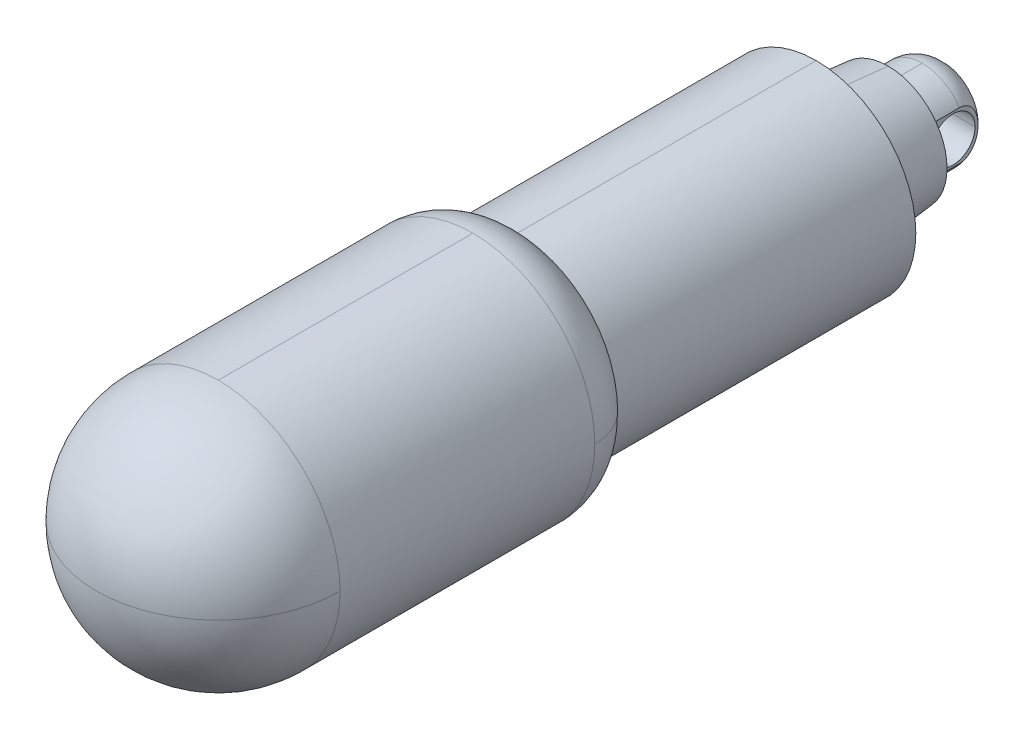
ISO-10303-21;
HEADER;
FILE_DESCRIPTION(('STEP AP214'),'2;1');
FILE_NAME('part.step','',(''),(''),'','','');
FILE_SCHEMA(('AUTOMOTIVE_DESIGN { 1 0 10303 214 1 1 1 1 }'));
ENDSEC;
DATA;
#1=APPLICATION_CONTEXT('core data for automotive mechanical design processes');
#2=APPLICATION_PROTOCOL_DEFINITION('international standard','automotive_design',2000,#1);
#3=PRODUCT_CONTEXT('',#1,'mechanical');
#4=PRODUCT('Part','Part','',(#3));
#5=PRODUCT_RELATED_PRODUCT_CATEGORY('part','',(#4));
#6=PRODUCT_DEFINITION_FORMATION('','',#4);
#7=PRODUCT_DEFINITION_CONTEXT('part definition',#1,'design');
#8=PRODUCT_DEFINITION('design','',#6,#7);
#9=PRODUCT_DEFINITION_SHAPE('','',#8);
#10=(LENGTH_UNIT() NAMED_UNIT(*) SI_UNIT(.MILLI.,.METRE.));
#11=(NAMED_UNIT(*) PLANE_ANGLE_UNIT() SI_UNIT($,.RADIAN.));
#12=(NAMED_UNIT(*) SI_UNIT($,.STERADIAN.) SOLID_ANGLE_UNIT());
#13=UNCERTAINTY_MEASURE_WITH_UNIT(LENGTH_MEASURE(1.E-05),#10,'distance_accuracy_value','');
#14=(GEOMETRIC_REPRESENTATION_CONTEXT(3) GLOBAL_UNCERTAINTY_ASSIGNED_CONTEXT((#13)) GLOBAL_UNIT_ASSIGNED_CONTEXT((#10,
#11,#12)) REPRESENTATION_CONTEXT('',''));
#15=CARTESIAN_POINT('',(0.,0.,0.));
#16=DIRECTION('',(0.,0.,1.));
#17=DIRECTION('',(1.,0.,0.));
#18=AXIS2_PLACEMENT_3D('',#15,#16,#17);
#19=CARTESIAN_POINT('',(0.,-0.75,-3.0833333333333));
#20=DIRECTION('',(0.,0.,-1.));
#21=DIRECTION('',(0.,-1.,0.));
#22=AXIS2_PLACEMENT_3D('',#19,#20,#21);
#23=PLANE('',#22);
#24=CARTESIAN_POINT('',(0.,0.,-3.0833333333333));
#25=DIRECTION('',(0.,0.,1.));
#26=DIRECTION('',(-1.,0.,0.));
#27=AXIS2_PLACEMENT_3D('',#24,#25,#26);
#28=CIRCLE('',#27,1.5);
#29=CARTESIAN_POINT('',(-1.5,0.,-3.0833333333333));
#30=VERTEX_POINT('',#29);
#31=CARTESIAN_POINT('',(0.,-1.5,-3.0833333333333));
#32=VERTEX_POINT('',#31);
#33=EDGE_CURVE('E134',#30,#32,#28,.T.);
#34=ORIENTED_EDGE('',*,*,#33,.F.);
#35=CARTESIAN_POINT('',(0.,0.,-3.0833333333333));
#36=DIRECTION('',(0.,0.,1.));
#37=DIRECTION('',(1.,0.,0.));
#38=AXIS2_PLACEMENT_3D('',#35,#36,#37);
#39=CIRCLE('',#38,1.5);
#40=CARTESIAN_POINT('',(1.5,0.,-3.0833333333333));
#41=VERTEX_POINT('',#40);
#42=EDGE_CURVE('E138',#41,#30,#39,.T.);
#43=ORIENTED_EDGE('',*,*,#42,.F.);
#44=CARTESIAN_POINT('',(0.,0.,-3.0833333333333));
#45=DIRECTION('',(0.,0.,1.));
#46=DIRECTION('',(0.,-1.,0.));
#47=AXIS2_PLACEMENT_3D('',#44,#45,#46);
#48=CIRCLE('',#47,1.5);
#49=EDGE_CURVE('E131',#32,#41,#48,.T.);
#50=ORIENTED_EDGE('',*,*,#49,.F.);
#51=EDGE_LOOP('',(#34,#43,#50));
#52=FACE_BOUND('',#51,.T.);
#53=ADVANCED_FACE('F14',(#52),#23,.T.);
#54=CARTESIAN_POINT('',(-11.,0.,0.));
#55=DIRECTION('',(-1.,0.,0.));
#56=DIRECTION('',(0.,-1.,0.));
#57=AXIS2_PLACEMENT_3D('',#54,#55,#56);
#58=CYLINDRICAL_SURFACE('',#57,2.);
#59=CARTESIAN_POINT('',(3.35,0.,0.));
#60=DIRECTION('',(-1.,0.,0.));
#61=DIRECTION('',(0.,-1.,0.));
#62=AXIS2_PLACEMENT_3D('',#59,#60,#61);
#63=CIRCLE('',#62,2.);
#64=CARTESIAN_POINT('',(3.35,0.,2.));
#65=VERTEX_POINT('',#64);
#66=CARTESIAN_POINT('',(3.35,0.,-2.));
#67=VERTEX_POINT('',#66);
#68=EDGE_CURVE('E201',#65,#67,#63,.F.);
#69=ORIENTED_EDGE('',*,*,#68,.T.);
#70=DIRECTION('',(-1.,0.,0.));
#71=VECTOR('',#70,1.);
#72=CARTESIAN_POINT('',(-11.,0.,-2.));
#73=LINE('',#72,#71);
#74=CARTESIAN_POINT('',(-3.35,0.,-2.));
#75=VERTEX_POINT('',#74);
#76=EDGE_CURVE('E112',#67,#75,#73,.T.);
#77=ORIENTED_EDGE('',*,*,#76,.T.);
#78=CARTESIAN_POINT('',(-3.35,0.,0.));
#79=DIRECTION('',(-1.,0.,0.));
#80=DIRECTION('',(0.,-1.,0.));
#81=AXIS2_PLACEMENT_3D('',#78,#79,#80);
#82=CIRCLE('',#81,2.);
#83=CARTESIAN_POINT('',(-3.35,0.,2.));
#84=VERTEX_POINT('',#83);
#85=EDGE_CURVE('E213',#75,#84,#82,.T.);
#86=ORIENTED_EDGE('',*,*,#85,.T.);
#87=DIRECTION('',(-1.,0.,0.));
#88=VECTOR('',#87,1.);
#89=CARTESIAN_POINT('',(-11.,0.,2.));
#90=LINE('',#89,#88);
#91=EDGE_CURVE('E150',#84,#65,#90,.F.);
#92=ORIENTED_EDGE('',*,*,#91,.T.);
#93=EDGE_LOOP('',(#69,#77,#86,#92));
#94=FACE_BOUND('',#93,.T.);
#95=ADVANCED_FACE('F411',(#94),#58,.F.);
#96=CARTESIAN_POINT('',(-11.,0.,0.));
#97=DIRECTION('',(-1.,0.,0.));
#98=DIRECTION('',(0.,-1.,0.));
#99=AXIS2_PLACEMENT_3D('',#96,#97,#98);
#100=CYLINDRICAL_SURFACE('',#99,2.);
#101=CARTESIAN_POINT('',(-3.35,0.,0.));
#102=DIRECTION('',(-1.,0.,0.));
#103=DIRECTION('',(0.,-1.,0.));
#104=AXIS2_PLACEMENT_3D('',#101,#102,#103);
#105=CIRCLE('',#104,2.);
#106=EDGE_CURVE('E318',#84,#75,#105,.T.);
#107=ORIENTED_EDGE('',*,*,#106,.T.);
#108=ORIENTED_EDGE('',*,*,#76,.F.);
#109=CARTESIAN_POINT('',(3.35,0.,0.));
#110=DIRECTION('',(-1.,0.,0.));
#111=DIRECTION('',(0.,-1.,0.));
#112=AXIS2_PLACEMENT_3D('',#109,#110,#111);
#113=CIRCLE('',#112,2.);
#114=EDGE_CURVE('E18',#67,#65,#113,.F.);
#115=ORIENTED_EDGE('',*,*,#114,.T.);
#116=ORIENTED_EDGE('',*,*,#91,.F.);
#117=EDGE_LOOP('',(#107,#108,#115,#116));
#118=FACE_BOUND('',#117,.T.);
#119=ADVANCED_FACE('F171',(#118),#100,.F.);
#120=CARTESIAN_POINT('',(1.5,0.,-0.583333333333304));
#121=DIRECTION('',(0.,1.,0.));
#122=DIRECTION('',(1.,0.,0.));
#123=AXIS2_PLACEMENT_3D('',#120,#121,#122);
#124=CIRCLE('',#123,2.5);
#125=TRIMMED_CURVE('',#124,(PARAMETER_VALUE(-2.21429743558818)),
(PARAMETER_VALUE(2.21429743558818)),.T.,.PARAMETER.);
#126=CARTESIAN_POINT('',(0.,0.,-0.583333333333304));
#127=DIRECTION('',(0.,0.,1.));
#128=AXIS1_PLACEMENT('',#126,#127);
#129=SURFACE_OF_REVOLUTION('',#125,#128);
#130=ORIENTED_EDGE('',*,*,#33,.T.);
#131=ORIENTED_EDGE('',*,*,#49,.T.);
#132=CARTESIAN_POINT('',(1.5,0.,-0.583333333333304));
#133=DIRECTION('',(0.,1.,0.));
#134=DIRECTION('',(1.,0.,0.));
#135=AXIS2_PLACEMENT_3D('',#132,#133,#134);
#136=CIRCLE('',#135,2.5);
#137=CARTESIAN_POINT('',(3.35,0.,-2.2648505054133));
#138=VERTEX_POINT('',#137);
#139=EDGE_CURVE('E143',#138,#41,#136,.T.);
#140=ORIENTED_EDGE('',*,*,#139,.F.);
#141=CARTESIAN_POINT('',(3.35,0.,-2.2648505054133));
#142=CARTESIAN_POINT('',(3.35,-0.0754425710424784,-2.26483182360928));
#143=CARTESIAN_POINT('',(3.35,-0.150894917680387,-2.26204566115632));
#144=CARTESIAN_POINT('',(3.35,-0.301463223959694,-2.25079679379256));
#145=CARTESIAN_POINT('',(3.35,-0.376578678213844,-2.24232735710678));
#146=CARTESIAN_POINT('',(3.35,-0.526652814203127,-2.21946055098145));
#147=CARTESIAN_POINT('',(3.35,-0.601603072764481,-2.20500707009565));
#148=CARTESIAN_POINT('',(3.35,-0.750000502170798,-2.16992943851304));
#149=CARTESIAN_POINT('',(3.35,-0.823448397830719,-2.14930834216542));
#150=CARTESIAN_POINT('',(3.35,-1.00988032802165,-2.08785206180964));
#151=CARTESIAN_POINT('',(3.35000000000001,-1.1213408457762,-2.04220953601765));
#152=CARTESIAN_POINT('',(3.34999999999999,-1.33522725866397,-1.93376510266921));
#153=CARTESIAN_POINT('',(3.34999999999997,-1.43768585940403,-1.87102902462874));
#154=CARTESIAN_POINT('',(3.35000000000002,-1.60964311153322,-1.74246365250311));
#155=CARTESIAN_POINT('',(3.35000000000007,-1.68158732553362,-1.67992206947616));
#156=CARTESIAN_POINT('',(3.34999999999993,-1.81436566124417,-1.54384878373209));
#157=CARTESIAN_POINT('',(3.34999999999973,-1.87519707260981,-1.4703144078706));
#158=CARTESIAN_POINT('',(3.34999999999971,-1.98313209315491,-1.31268560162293));
#159=CARTESIAN_POINT('',(3.34999999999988,-2.03011755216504,-1.22850857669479));
#160=CARTESIAN_POINT('',(3.35000000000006,-2.08749421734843,-1.09673181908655));
#161=CARTESIAN_POINT('',(3.35000000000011,-2.10443360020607,-1.0518995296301));
#162=CARTESIAN_POINT('',(3.34999999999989,-2.13369721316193,-0.960761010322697));
#163=CARTESIAN_POINT('',(3.34999999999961,-2.14602396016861,-0.914455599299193));
#164=CARTESIAN_POINT('',(3.34999999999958,-2.16580487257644,-0.820926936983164));
#165=CARTESIAN_POINT('',(3.34999999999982,-2.17327015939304,-0.773706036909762));
#166=CARTESIAN_POINT('',(3.35000000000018,-2.18324910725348,-0.678770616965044));
#167=CARTESIAN_POINT('',(3.35000000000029,-2.1857654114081,-0.63105637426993));
#168=CARTESIAN_POINT('',(3.35,-2.18574929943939,-0.583333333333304));
#169=B_SPLINE_CURVE_WITH_KNOTS('',3,(#141,#142,#143,#144,#145,#146,#147,#148,#149,#150,#151,
#152,#153,#154,#155,#156,#157,#158,#159,#160,#161,#162,#163,#164,#165,#166,#167,#168),
.UNSPECIFIED.,.F.,.F.,(4,2,2,2,2,2,2,2,2,2,2,2,2,4),(0.,0.2262913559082,0.452851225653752,
0.681585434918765,0.910206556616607,1.27014773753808,1.62872186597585,1.91357555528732,
2.19849862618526,2.48578692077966,2.62935968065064,2.77285398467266,2.91601885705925,
3.05910724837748),.UNSPECIFIED.);
#170=CARTESIAN_POINT('',(3.35,-2.1857492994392,-0.583333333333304));
#171=VERTEX_POINT('',#170);
#172=EDGE_CURVE('E312',#138,#171,#169,.T.);
#173=ORIENTED_EDGE('',*,*,#172,.T.);
#174=CARTESIAN_POINT('',(0.,0.,-0.583333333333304));
#175=DIRECTION('',(0.,0.,-1.));
#176=DIRECTION('',(1.,0.,0.));
#177=AXIS2_PLACEMENT_3D('',#174,#175,#176);
#178=CIRCLE('',#177,4.);
#179=CARTESIAN_POINT('',(0.,-4.,-0.583333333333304));
#180=VERTEX_POINT('',#179);
#181=EDGE_CURVE('E195',#180,#171,#178,.F.);
#182=ORIENTED_EDGE('',*,*,#181,.F.);
#183=CARTESIAN_POINT('',(0.,0.,-0.583333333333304));
#184=DIRECTION('',(0.,0.,-1.));
#185=DIRECTION('',(1.,0.,0.));
#186=AXIS2_PLACEMENT_3D('',#183,#184,#185);
#187=CIRCLE('',#186,4.);
#188=CARTESIAN_POINT('',(-3.35,-2.1857492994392,-0.583333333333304));
#189=VERTEX_POINT('',#188);
#190=EDGE_CURVE('E119',#189,#180,#187,.F.);
#191=ORIENTED_EDGE('',*,*,#190,.F.);
#192=CARTESIAN_POINT('',(-3.35,-2.18574929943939,-0.583333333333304));
#193=CARTESIAN_POINT('',(-3.35,-2.1857602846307,-0.626622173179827));
#194=CARTESIAN_POINT('',(-3.35,-2.18369202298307,-0.669905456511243));
#195=CARTESIAN_POINT('',(-3.35,-2.17548130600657,-0.756064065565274));
#196=CARTESIAN_POINT('',(-3.35,-2.16934076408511,-0.798939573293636));
#197=CARTESIAN_POINT('',(-3.35,-2.15311794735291,-0.883674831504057));
#198=CARTESIAN_POINT('',(-3.35,-2.14305929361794,-0.925539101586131));
#199=CARTESIAN_POINT('',(-3.35,-2.11916399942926,-1.008163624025));
#200=CARTESIAN_POINT('',(-3.35,-2.10532713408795,-1.04892381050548));
#201=CARTESIAN_POINT('',(-3.35,-2.05847222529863,-1.16896268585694));
#202=CARTESIAN_POINT('',(-3.35,-2.02006977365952,-1.24620337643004));
#203=CARTESIAN_POINT('',(-3.35,-1.93091834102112,-1.39316793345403));
#204=CARTESIAN_POINT('',(-3.35,-1.88015621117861,-1.46288367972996));
#205=CARTESIAN_POINT('',(-3.35,-1.768402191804,-1.5937973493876));
#206=CARTESIAN_POINT('',(-3.35,-1.70738594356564,-1.65497434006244));
#207=CARTESIAN_POINT('',(-3.35,-1.57742304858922,-1.76811368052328));
#208=CARTESIAN_POINT('',(-3.35,-1.50847575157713,-1.82007527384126));
#209=CARTESIAN_POINT('',(-3.35,-1.32954562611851,-1.93786242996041));
#210=CARTESIAN_POINT('',(-3.35,-1.21590781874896,-1.99814822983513));
#211=CARTESIAN_POINT('',(-3.35,-0.980125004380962,-2.09968218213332));
#212=CARTESIAN_POINT('',(-3.34999999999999,-0.857950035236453,-2.14085896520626));
#213=CARTESIAN_POINT('',(-3.35,-0.673529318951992,-2.1887320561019));
#214=CARTESIAN_POINT('',(-3.35000000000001,-0.612952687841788,-2.20224909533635));
#215=CARTESIAN_POINT('',(-3.34999999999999,-0.491029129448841,-2.22529015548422));
#216=CARTESIAN_POINT('',(-3.34999999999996,-0.429682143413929,-2.23481386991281));
#217=CARTESIAN_POINT('',(-3.35000000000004,-0.307044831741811,-2.24991444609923));
#218=CARTESIAN_POINT('',(-3.35000000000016,-0.245758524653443,-2.25552442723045));
#219=CARTESIAN_POINT('',(-3.34999999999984,-0.122980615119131,-2.26298753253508));
#220=CARTESIAN_POINT('',(-3.34999999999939,-0.0614891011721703,-2.2648421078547));
#221=CARTESIAN_POINT('',(-3.3499999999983,0.,-2.2648505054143));
#222=B_SPLINE_CURVE_WITH_KNOTS('',3,(#192,#193,#194,#195,#196,#197,#198,#199,#200,#201,#202,
#203,#204,#205,#206,#207,#208,#209,#210,#211,#212,#213,#214,#215,#216,#217,#218,#219,#220,#221),
.UNSPECIFIED.,.F.,.F.,(4,2,2,2,2,2,2,2,2,2,2,2,2,2,4),(0.,0.12980795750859,0.259554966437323,
0.388531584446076,0.517515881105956,0.774870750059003,1.03250061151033,1.29075135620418,
1.54902329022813,1.93284731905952,2.31809356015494,2.50418781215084,2.69029634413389,
2.87481020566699,3.05925275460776),.UNSPECIFIED.);
#223=CARTESIAN_POINT('',(-3.35,0.,-2.2648505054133));
#224=VERTEX_POINT('',#223);
#225=EDGE_CURVE('E263',#189,#224,#222,.T.);
#226=ORIENTED_EDGE('',*,*,#225,.T.);
#227=CARTESIAN_POINT('',(-1.5,0.,-0.583333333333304));
#228=DIRECTION('',(0.,-1.,0.));
#229=DIRECTION('',(-1.,0.,0.));
#230=AXIS2_PLACEMENT_3D('',#227,#228,#229);
#231=CIRCLE('',#230,2.5);
#232=EDGE_CURVE('E149',#30,#224,#231,.F.);
#233=ORIENTED_EDGE('',*,*,#232,.F.);
#234=EDGE_LOOP('',(#130,#131,#140,#173,#182,#191,#226,#233));
#235=FACE_BOUND('',#234,.T.);
#236=ADVANCED_FACE('F147',(#235),#129,.F.);
#237=CARTESIAN_POINT('',(1.5,0.,-0.583333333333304));
#238=DIRECTION('',(0.,1.,0.));
#239=DIRECTION('',(1.,0.,0.));
#240=AXIS2_PLACEMENT_3D('',#237,#238,#239);
#241=CIRCLE('',#240,2.5);
#242=TRIMMED_CURVE('',#241,(PARAMETER_VALUE(-2.21429743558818)),
(PARAMETER_VALUE(2.21429743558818)),.T.,.PARAMETER.);
#243=CARTESIAN_POINT('',(0.,0.,-0.583333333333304));
#244=DIRECTION('',(0.,0.,1.));
#245=AXIS1_PLACEMENT('',#243,#244);
#246=SURFACE_OF_REVOLUTION('',#242,#245);
#247=CARTESIAN_POINT('',(0.,0.,-0.583333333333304));
#248=DIRECTION('',(0.,0.,-1.));
#249=DIRECTION('',(1.,0.,0.));
#250=AXIS2_PLACEMENT_3D('',#247,#248,#249);
#251=CIRCLE('',#250,4.);
#252=CARTESIAN_POINT('',(3.35,2.18574929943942,-0.583333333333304));
#253=VERTEX_POINT('',#252);
#254=CARTESIAN_POINT('',(0.,4.,-0.583333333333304));
#255=VERTEX_POINT('',#254);
#256=EDGE_CURVE('E188',#253,#255,#251,.F.);
#257=ORIENTED_EDGE('',*,*,#256,.F.);
#258=CARTESIAN_POINT('',(3.35,2.18574929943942,-0.583333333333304));
#259=CARTESIAN_POINT('',(3.35,2.18576028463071,-0.62662217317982));
#260=CARTESIAN_POINT('',(3.35,2.18369202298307,-0.669905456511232));
#261=CARTESIAN_POINT('',(3.35,2.17548130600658,-0.756064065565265));
#262=CARTESIAN_POINT('',(3.35,2.16934076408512,-0.798939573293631));
#263=CARTESIAN_POINT('',(3.35,2.15311794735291,-0.883674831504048));
#264=CARTESIAN_POINT('',(3.35,2.14305929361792,-0.925539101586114));
#265=CARTESIAN_POINT('',(3.35,2.11916399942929,-1.00816362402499));
#266=CARTESIAN_POINT('',(3.35,2.10532713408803,-1.04892381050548));
#267=CARTESIAN_POINT('',(3.35,2.05847222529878,-1.16896268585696));
#268=CARTESIAN_POINT('',(3.35,2.02006977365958,-1.24620337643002));
#269=CARTESIAN_POINT('',(3.35,1.93091834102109,-1.393167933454));
#270=CARTESIAN_POINT('',(3.35,1.88015621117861,-1.46288367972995));
#271=CARTESIAN_POINT('',(3.35,1.76840219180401,-1.5937973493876));
#272=CARTESIAN_POINT('',(3.35,1.70738594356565,-1.65497434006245));
#273=CARTESIAN_POINT('',(3.35,1.57742304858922,-1.76811368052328));
#274=CARTESIAN_POINT('',(3.35,1.50847575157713,-1.82007527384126));
#275=CARTESIAN_POINT('',(3.35,1.32954562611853,-1.9378624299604));
#276=CARTESIAN_POINT('',(3.35,1.21590781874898,-1.9981482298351));
#277=CARTESIAN_POINT('',(3.35,0.980125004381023,-2.0996821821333));
#278=CARTESIAN_POINT('',(3.34999999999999,0.857950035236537,-2.14085896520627));
#279=CARTESIAN_POINT('',(3.35,0.673529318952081,-2.1887320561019));
#280=CARTESIAN_POINT('',(3.35000000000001,0.612952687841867,-2.20224909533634));
#281=CARTESIAN_POINT('',(3.34999999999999,0.491029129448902,-2.2252901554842));
#282=CARTESIAN_POINT('',(3.34999999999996,0.429682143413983,-2.2348138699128));
#283=CARTESIAN_POINT('',(3.35000000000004,0.30704483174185,-2.24991444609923));
#284=CARTESIAN_POINT('',(3.35000000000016,0.245758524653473,-2.25552442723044));
#285=CARTESIAN_POINT('',(3.34999999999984,0.122980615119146,-2.26298753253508));
#286=CARTESIAN_POINT('',(3.34999999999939,0.0614891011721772,-2.2648421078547));
#287=CARTESIAN_POINT('',(3.3499999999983,0.,-2.2648505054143));
#288=B_SPLINE_CURVE_WITH_KNOTS('',3,(#258,#259,#260,#261,#262,#263,#264,#265,#266,#267,#268,
#269,#270,#271,#272,#273,#274,#275,#276,#277,#278,#279,#280,#281,#282,#283,#284,#285,#286,#287),
.UNSPECIFIED.,.F.,.F.,(4,2,2,2,2,2,2,2,2,2,2,2,2,2,4),(0.,0.129807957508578,0.259554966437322,
0.388531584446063,0.517515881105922,0.77487075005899,1.03250061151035,1.2907513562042,
1.54902329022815,1.93284731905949,2.31809356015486,2.50418781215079,2.69029634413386,
2.87481020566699,3.05925275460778),.UNSPECIFIED.);
#289=EDGE_CURVE('E306',#253,#138,#288,.T.);
#290=ORIENTED_EDGE('',*,*,#289,.T.);
#291=ORIENTED_EDGE('',*,*,#139,.T.);
#292=ORIENTED_EDGE('',*,*,#42,.T.);
#293=ORIENTED_EDGE('',*,*,#232,.T.);
#294=CARTESIAN_POINT('',(-3.35,0.,-2.2648505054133));
#295=CARTESIAN_POINT('',(-3.35,0.0754425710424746,-2.26483182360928));
#296=CARTESIAN_POINT('',(-3.35,0.150894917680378,-2.26204566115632));
#297=CARTESIAN_POINT('',(-3.35,0.301463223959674,-2.25079679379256));
#298=CARTESIAN_POINT('',(-3.35,0.376578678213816,-2.24232735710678));
#299=CARTESIAN_POINT('',(-3.35,0.526652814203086,-2.21946055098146));
#300=CARTESIAN_POINT('',(-3.35,0.601603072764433,-2.20500707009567));
#301=CARTESIAN_POINT('',(-3.35,0.750000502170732,-2.16992943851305));
#302=CARTESIAN_POINT('',(-3.35,0.823448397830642,-2.14930834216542));
#303=CARTESIAN_POINT('',(-3.35,1.00988032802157,-2.08785206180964));
#304=CARTESIAN_POINT('',(-3.35000000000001,1.12134084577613,-2.04220953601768));
#305=CARTESIAN_POINT('',(-3.34999999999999,1.3352272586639,-1.93376510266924));
#306=CARTESIAN_POINT('',(-3.34999999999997,1.43768585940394,-1.87102902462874));
#307=CARTESIAN_POINT('',(-3.35000000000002,1.60964311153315,-1.7424636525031));
#308=CARTESIAN_POINT('',(-3.35000000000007,1.68158732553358,-1.67992206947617));
#309=CARTESIAN_POINT('',(-3.34999999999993,1.81436566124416,-1.54384878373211));
#310=CARTESIAN_POINT('',(-3.34999999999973,1.87519707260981,-1.47031440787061));
#311=CARTESIAN_POINT('',(-3.34999999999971,1.98313209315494,-1.31268560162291));
#312=CARTESIAN_POINT('',(-3.34999999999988,2.03011755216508,-1.22850857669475));
#313=CARTESIAN_POINT('',(-3.35000000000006,2.08749421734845,-1.09673181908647));
#314=CARTESIAN_POINT('',(-3.35000000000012,2.10443360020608,-1.05189952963));
#315=CARTESIAN_POINT('',(-3.34999999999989,2.13369721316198,-0.960761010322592));
#316=CARTESIAN_POINT('',(-3.34999999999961,2.14602396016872,-0.914455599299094));
#317=CARTESIAN_POINT('',(-3.34999999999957,2.16580487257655,-0.820926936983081));
#318=CARTESIAN_POINT('',(-3.34999999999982,2.17327015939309,-0.77370603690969));
#319=CARTESIAN_POINT('',(-3.35000000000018,2.18324910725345,-0.678770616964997));
#320=CARTESIAN_POINT('',(-3.35000000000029,2.18576541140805,-0.631056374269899));
#321=CARTESIAN_POINT('',(-3.35,2.18574929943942,-0.583333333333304));
#322=B_SPLINE_CURVE_WITH_KNOTS('',3,(#294,#295,#296,#297,#298,#299,#300,#301,#302,#303,#304,
#305,#306,#307,#308,#309,#310,#311,#312,#313,#314,#315,#316,#317,#318,#319,#320,#321),
.UNSPECIFIED.,.F.,.F.,(4,2,2,2,2,2,2,2,2,2,2,2,2,4),(0.,0.226291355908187,0.452851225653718,
0.681585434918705,0.910206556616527,1.270147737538,1.62872186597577,1.91357555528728,
2.19849862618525,2.48578692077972,2.62935968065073,2.77285398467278,2.9160188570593,
3.05910724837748),.UNSPECIFIED.);
#323=CARTESIAN_POINT('',(-3.35,2.18574929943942,-0.583333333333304));
#324=VERTEX_POINT('',#323);
#325=EDGE_CURVE('E256',#224,#324,#322,.T.);
#326=ORIENTED_EDGE('',*,*,#325,.T.);
#327=CARTESIAN_POINT('',(0.,0.,-0.583333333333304));
#328=DIRECTION('',(0.,0.,-1.));
#329=DIRECTION('',(1.,0.,0.));
#330=AXIS2_PLACEMENT_3D('',#327,#328,#329);
#331=CIRCLE('',#330,4.);
#332=EDGE_CURVE('E210',#255,#324,#331,.F.);
#333=ORIENTED_EDGE('',*,*,#332,.F.);
#334=EDGE_LOOP('',(#257,#290,#291,#292,#293,#326,#333));
#335=FACE_BOUND('',#334,.T.);
#336=ADVANCED_FACE('F170',(#335),#246,.F.);
#337=CARTESIAN_POINT('',(0.,0.,0.958333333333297));
#338=DIRECTION('',(0.,0.,-1.));
#339=DIRECTION('',(1.,0.,0.));
#340=AXIS2_PLACEMENT_3D('',#337,#338,#339);
#341=CYLINDRICAL_SURFACE('',#340,4.);
#342=DIRECTION('',(0.,0.,1.));
#343=VECTOR('',#342,1.);
#344=CARTESIAN_POINT('',(-3.35,-2.18574929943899,2.5));
#345=LINE('',#344,#343);
#346=CARTESIAN_POINT('',(-3.35,-2.1857492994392,2.5));
#347=VERTEX_POINT('',#346);
#348=EDGE_CURVE('E269',#347,#189,#345,.F.);
#349=ORIENTED_EDGE('',*,*,#348,.T.);
#350=ORIENTED_EDGE('',*,*,#190,.T.);
#351=DIRECTION('',(0.,0.,-1.));
#352=VECTOR('',#351,1.);
#353=CARTESIAN_POINT('',(0.,-4.,0.958333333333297));
#354=LINE('',#353,#352);
#355=CARTESIAN_POINT('',(0.,-4.,2.5));
#356=VERTEX_POINT('',#355);
#357=EDGE_CURVE('E183',#356,#180,#354,.T.);
#358=ORIENTED_EDGE('',*,*,#357,.F.);
#359=CARTESIAN_POINT('',(0.,0.,2.5));
#360=DIRECTION('',(0.,0.,-1.));
#361=DIRECTION('',(1.,0.,0.));
#362=AXIS2_PLACEMENT_3D('',#359,#360,#361);
#363=CIRCLE('',#362,4.);
#364=EDGE_CURVE('E267',#347,#356,#363,.F.);
#365=ORIENTED_EDGE('',*,*,#364,.F.);
#366=EDGE_LOOP('',(#349,#350,#358,#365));
#367=FACE_BOUND('',#366,.T.);
#368=ADVANCED_FACE('F660',(#367),#341,.T.);
#369=CARTESIAN_POINT('',(0.,0.,0.958333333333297));
#370=DIRECTION('',(0.,0.,-1.));
#371=DIRECTION('',(1.,0.,0.));
#372=AXIS2_PLACEMENT_3D('',#369,#370,#371);
#373=CYLINDRICAL_SURFACE('',#372,4.);
#374=DIRECTION('',(0.,0.,-1.));
#375=VECTOR('',#374,1.);
#376=CARTESIAN_POINT('',(3.35,-2.18574929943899,-2.5833333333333));
#377=LINE('',#376,#375);
#378=CARTESIAN_POINT('',(3.35,-2.1857492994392,2.5));
#379=VERTEX_POINT('',#378);
#380=EDGE_CURVE('E206',#171,#379,#377,.F.);
#381=ORIENTED_EDGE('',*,*,#380,.T.);
#382=CARTESIAN_POINT('',(0.,0.,2.5));
#383=DIRECTION('',(0.,0.,-1.));
#384=DIRECTION('',(1.,0.,0.));
#385=AXIS2_PLACEMENT_3D('',#382,#383,#384);
#386=CIRCLE('',#385,4.);
#387=EDGE_CURVE('E332',#356,#379,#386,.F.);
#388=ORIENTED_EDGE('',*,*,#387,.F.);
#389=ORIENTED_EDGE('',*,*,#357,.T.);
#390=ORIENTED_EDGE('',*,*,#181,.T.);
#391=EDGE_LOOP('',(#381,#388,#389,#390));
#392=FACE_BOUND('',#391,.T.);
#393=ADVANCED_FACE('F302',(#392),#373,.T.);
#394=CARTESIAN_POINT('',(3.35,11.,-2.5833333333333));
#395=DIRECTION('',(-1.,0.,0.));
#396=DIRECTION('',(0.,0.,-1.));
#397=AXIS2_PLACEMENT_3D('',#394,#395,#396);
#398=PLANE('',#397);
#399=ORIENTED_EDGE('',*,*,#172,.F.);
#400=ORIENTED_EDGE('',*,*,#289,.F.);
#401=DIRECTION('',(0.,0.,-1.));
#402=VECTOR('',#401,1.);
#403=CARTESIAN_POINT('',(3.35,2.18574929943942,0.958333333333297));
#404=LINE('',#403,#402);
#405=CARTESIAN_POINT('',(3.35,2.18574929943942,2.5));
#406=VERTEX_POINT('',#405);
#407=EDGE_CURVE('E192',#406,#253,#404,.T.);
#408=ORIENTED_EDGE('',*,*,#407,.F.);
#409=DIRECTION('',(0.,-1.,0.));
#410=VECTOR('',#409,1.);
#411=CARTESIAN_POINT('',(3.35,-4.65841123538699,2.5));
#412=LINE('',#411,#410);
#413=EDGE_CURVE('E336',#379,#406,#412,.F.);
#414=ORIENTED_EDGE('',*,*,#413,.F.);
#415=ORIENTED_EDGE('',*,*,#380,.F.);
#416=EDGE_LOOP('',(#399,#400,#408,#414,#415));
#417=FACE_BOUND('',#416,.T.);
#418=ORIENTED_EDGE('',*,*,#114,.F.);
#419=ORIENTED_EDGE('',*,*,#68,.F.);
#420=EDGE_LOOP('',(#418,#419));
#421=FACE_BOUND('',#420,.T.);
#422=ADVANCED_FACE('F297',(#417,#421),#398,.F.);
#423=CARTESIAN_POINT('',(0.,0.,0.958333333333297));
#424=DIRECTION('',(0.,0.,-1.));
#425=DIRECTION('',(1.,0.,0.));
#426=AXIS2_PLACEMENT_3D('',#423,#424,#425);
#427=CYLINDRICAL_SURFACE('',#426,4.);
#428=ORIENTED_EDGE('',*,*,#407,.T.);
#429=ORIENTED_EDGE('',*,*,#256,.T.);
#430=DIRECTION('',(0.,0.,-1.));
#431=VECTOR('',#430,1.);
#432=CARTESIAN_POINT('',(0.,4.,0.958333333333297));
#433=LINE('',#432,#431);
#434=CARTESIAN_POINT('',(0.,4.,2.5));
#435=VERTEX_POINT('',#434);
#436=EDGE_CURVE('E191',#435,#255,#433,.T.);
#437=ORIENTED_EDGE('',*,*,#436,.F.);
#438=CARTESIAN_POINT('',(0.,0.,2.5));
#439=DIRECTION('',(0.,0.,-1.));
#440=DIRECTION('',(1.,0.,0.));
#441=AXIS2_PLACEMENT_3D('',#438,#439,#440);
#442=CIRCLE('',#441,4.);
#443=EDGE_CURVE('E340',#406,#435,#442,.F.);
#444=ORIENTED_EDGE('',*,*,#443,.F.);
#445=EDGE_LOOP('',(#428,#429,#437,#444));
#446=FACE_BOUND('',#445,.T.);
#447=ADVANCED_FACE('F293',(#446),#427,.T.);
#448=CARTESIAN_POINT('',(0.,0.,0.958333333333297));
#449=DIRECTION('',(0.,0.,-1.));
#450=DIRECTION('',(1.,0.,0.));
#451=AXIS2_PLACEMENT_3D('',#448,#449,#450);
#452=CYLINDRICAL_SURFACE('',#451,4.);
#453=DIRECTION('',(0.,0.,1.));
#454=VECTOR('',#453,1.);
#455=CARTESIAN_POINT('',(-3.35,2.18574929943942,2.5));
#456=LINE('',#455,#454);
#457=CARTESIAN_POINT('',(-3.35,2.18574929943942,2.5));
#458=VERTEX_POINT('',#457);
#459=EDGE_CURVE('E265',#324,#458,#456,.T.);
#460=ORIENTED_EDGE('',*,*,#459,.T.);
#461=CARTESIAN_POINT('',(0.,0.,2.5));
#462=DIRECTION('',(0.,0.,-1.));
#463=DIRECTION('',(1.,0.,0.));
#464=AXIS2_PLACEMENT_3D('',#461,#462,#463);
#465=CIRCLE('',#464,4.);
#466=EDGE_CURVE('E346',#435,#458,#465,.F.);
#467=ORIENTED_EDGE('',*,*,#466,.F.);
#468=ORIENTED_EDGE('',*,*,#436,.T.);
#469=ORIENTED_EDGE('',*,*,#332,.T.);
#470=EDGE_LOOP('',(#460,#467,#468,#469));
#471=FACE_BOUND('',#470,.T.);
#472=ADVANCED_FACE('F288',(#471),#452,.T.);
#473=CARTESIAN_POINT('',(-3.35,11.,2.5));
#474=DIRECTION('',(1.,0.,0.));
#475=DIRECTION('',(0.,0.,1.));
#476=AXIS2_PLACEMENT_3D('',#473,#474,#475);
#477=PLANE('',#476);
#478=ORIENTED_EDGE('',*,*,#325,.F.);
#479=ORIENTED_EDGE('',*,*,#225,.F.);
#480=ORIENTED_EDGE('',*,*,#348,.F.);
#481=DIRECTION('',(0.,-1.,0.));
#482=VECTOR('',#481,1.);
#483=CARTESIAN_POINT('',(-3.35,-4.65841123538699,2.5));
#484=LINE('',#483,#482);
#485=EDGE_CURVE('E348',#458,#347,#484,.T.);
#486=ORIENTED_EDGE('',*,*,#485,.F.);
#487=ORIENTED_EDGE('',*,*,#459,.F.);
#488=EDGE_LOOP('',(#478,#479,#480,#486,#487));
#489=FACE_BOUND('',#488,.T.);
#490=ORIENTED_EDGE('',*,*,#85,.F.);
#491=ORIENTED_EDGE('',*,*,#106,.F.);
#492=EDGE_LOOP('',(#490,#491));
#493=FACE_BOUND('',#492,.T.);
#494=ADVANCED_FACE('F260',(#489,#493),#477,.F.);
#495=CARTESIAN_POINT('',(0.,-4.65841123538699,2.5));
#496=DIRECTION('',(0.,0.,-1.));
#497=DIRECTION('',(0.,-1.,0.));
#498=AXIS2_PLACEMENT_3D('',#495,#496,#497);
#499=PLANE('',#498);
#500=ORIENTED_EDGE('',*,*,#466,.T.);
#501=ORIENTED_EDGE('',*,*,#485,.T.);
#502=ORIENTED_EDGE('',*,*,#364,.T.);
#503=ORIENTED_EDGE('',*,*,#387,.T.);
#504=ORIENTED_EDGE('',*,*,#413,.T.);
#505=ORIENTED_EDGE('',*,*,#443,.T.);
#506=EDGE_LOOP('',(#500,#501,#502,#503,#504,#505));
#507=FACE_BOUND('',#506,.T.);
#508=CARTESIAN_POINT('',(0.,0.,2.4999999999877));
#509=DIRECTION('',(0.,0.,1.));
#510=DIRECTION('',(-1.,0.,0.));
#511=AXIS2_PLACEMENT_3D('',#508,#509,#510);
#512=CIRCLE('',#511,5.31682247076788);
#513=CARTESIAN_POINT('',(0.,5.31682247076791,2.4999999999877));
#514=VERTEX_POINT('',#513);
#515=CARTESIAN_POINT('',(-3.34999999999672,-4.128692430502,2.4999999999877));
#516=VERTEX_POINT('',#515);
#517=EDGE_CURVE('E352',#514,#516,#512,.T.);
#518=ORIENTED_EDGE('',*,*,#517,.F.);
#519=CARTESIAN_POINT('',(0.,0.,2.4999999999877));
#520=DIRECTION('',(0.,0.,1.));
#521=DIRECTION('',(-1.,0.,0.));
#522=AXIS2_PLACEMENT_3D('',#519,#520,#521);
#523=CIRCLE('',#522,5.31682247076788);
#524=CARTESIAN_POINT('',(0.,-5.3168224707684,2.4999999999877));
#525=VERTEX_POINT('',#524);
#526=EDGE_CURVE('E349',#525,#514,#523,.T.);
#527=ORIENTED_EDGE('',*,*,#526,.F.);
#528=CARTESIAN_POINT('',(0.,0.,2.4999999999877));
#529=DIRECTION('',(0.,0.,1.));
#530=DIRECTION('',(-1.,0.,0.));
#531=AXIS2_PLACEMENT_3D('',#528,#529,#530);
#532=CIRCLE('',#531,5.31682247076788);
#533=EDGE_CURVE('E355',#516,#525,#532,.T.);
#534=ORIENTED_EDGE('',*,*,#533,.F.);
#535=EDGE_LOOP('',(#518,#527,#534));
#536=FACE_BOUND('',#535,.T.);
#537=ADVANCED_FACE('F287',(#507,#536),#499,.T.);
#538=CARTESIAN_POINT('',(0.,0.,8.9999999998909));
#539=DIRECTION('',(0.,0.,1.));
#540=DIRECTION('',(-1.,0.,0.));
#541=AXIS2_PLACEMENT_3D('',#538,#539,#540);
#542=CONICAL_SURFACE('',#541,5.99999999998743,0.104719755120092);
#543=DIRECTION('',(0.,-0.104528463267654,-0.994521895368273));
#544=VECTOR('',#543,1.);
#545=CARTESIAN_POINT('',(-6.42247713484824E-12,52446.9699040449,498951.5));
#546=LINE('',#545,#544);
#547=CARTESIAN_POINT('',(0.,6.,9.0000000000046));
#548=VERTEX_POINT('',#547);
#549=EDGE_CURVE('E356',#548,#514,#546,.T.);
#550=ORIENTED_EDGE('',*,*,#549,.F.);
#551=CARTESIAN_POINT('',(0.,0.,9.0000000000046));
#552=DIRECTION('',(0.,0.,1.));
#553=DIRECTION('',(-1.,0.,0.));
#554=AXIS2_PLACEMENT_3D('',#551,#552,#553);
#555=CIRCLE('',#554,5.99999999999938);
#556=CARTESIAN_POINT('',(0.,-6.,9.0000000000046));
#557=VERTEX_POINT('',#556);
#558=EDGE_CURVE('E359',#557,#548,#555,.T.);
#559=ORIENTED_EDGE('',*,*,#558,.F.);
#560=DIRECTION('',(0.,0.104528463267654,-0.994521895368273));
#561=VECTOR('',#560,1.);
#562=CARTESIAN_POINT('',(1.28453785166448E-11,-52446.9699040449,498951.5));
#563=LINE('',#562,#561);
#564=EDGE_CURVE('E351',#525,#557,#563,.F.);
#565=ORIENTED_EDGE('',*,*,#564,.F.);
#566=ORIENTED_EDGE('',*,*,#526,.T.);
#567=EDGE_LOOP('',(#550,#559,#565,#566));
#568=FACE_BOUND('',#567,.T.);
#569=ADVANCED_FACE('F617',(#568),#542,.T.);
#570=CARTESIAN_POINT('',(0.,0.,8.9999999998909));
#571=DIRECTION('',(0.,0.,1.));
#572=DIRECTION('',(-1.,0.,0.));
#573=AXIS2_PLACEMENT_3D('',#570,#571,#572);
#574=CONICAL_SURFACE('',#573,5.99999999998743,0.104719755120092);
#575=ORIENTED_EDGE('',*,*,#517,.T.);
#576=ORIENTED_EDGE('',*,*,#533,.T.);
#577=ORIENTED_EDGE('',*,*,#564,.T.);
#578=CARTESIAN_POINT('',(0.,0.,9.0000000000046));
#579=DIRECTION('',(0.,0.,1.));
#580=DIRECTION('',(-1.,0.,0.));
#581=AXIS2_PLACEMENT_3D('',#578,#579,#580);
#582=CIRCLE('',#581,5.99999999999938);
#583=EDGE_CURVE('E362',#548,#557,#582,.T.);
#584=ORIENTED_EDGE('',*,*,#583,.F.);
#585=ORIENTED_EDGE('',*,*,#549,.T.);
#586=EDGE_LOOP('',(#575,#576,#577,#584,#585));
#587=FACE_BOUND('',#586,.T.);
#588=ADVANCED_FACE('F608',(#587),#574,.T.);
#589=CARTESIAN_POINT('',(0.,-7.5,9.));
#590=DIRECTION('',(0.,0.,-1.));
#591=DIRECTION('',(0.,-1.,0.));
#592=AXIS2_PLACEMENT_3D('',#589,#590,#591);
#593=PLANE('',#592);
#594=ORIENTED_EDGE('',*,*,#558,.T.);
#595=ORIENTED_EDGE('',*,*,#583,.T.);
#596=EDGE_LOOP('',(#594,#595));
#597=FACE_BOUND('',#596,.T.);
#598=CARTESIAN_POINT('',(0.,0.,9.));
#599=DIRECTION('',(0.,0.,-1.));
#600=DIRECTION('',(1.,0.,0.));
#601=AXIS2_PLACEMENT_3D('',#598,#599,#600);
#602=CIRCLE('',#601,9.);
#603=CARTESIAN_POINT('',(0.,-9.,9.));
#604=VERTEX_POINT('',#603);
#605=CARTESIAN_POINT('',(0.,9.,9.));
#606=VERTEX_POINT('',#605);
#607=EDGE_CURVE('E365',#604,#606,#602,.F.);
#608=ORIENTED_EDGE('',*,*,#607,.F.);
#609=CARTESIAN_POINT('',(0.,0.,9.));
#610=DIRECTION('',(0.,0.,-1.));
#611=DIRECTION('',(1.,0.,0.));
#612=AXIS2_PLACEMENT_3D('',#609,#610,#611);
#613=CIRCLE('',#612,9.);
#614=EDGE_CURVE('E368',#606,#604,#613,.F.);
#615=ORIENTED_EDGE('',*,*,#614,.F.);
#616=EDGE_LOOP('',(#608,#615));
#617=FACE_BOUND('',#616,.T.);
#618=ADVANCED_FACE('F601',(#597,#617),#593,.T.);
#619=CARTESIAN_POINT('',(0.,0.,22.5));
#620=DIRECTION('',(0.,0.,-1.));
#621=DIRECTION('',(1.,0.,0.));
#622=AXIS2_PLACEMENT_3D('',#619,#620,#621);
#623=CYLINDRICAL_SURFACE('',#622,9.);
#624=CARTESIAN_POINT('',(0.,0.,36.));
#625=DIRECTION('',(0.,0.,1.));
#626=DIRECTION('',(1.,0.,0.));
#627=AXIS2_PLACEMENT_3D('',#624,#625,#626);
#628=CIRCLE('',#627,9.);
#629=CARTESIAN_POINT('',(9.,0.,36.));
#630=VERTEX_POINT('',#629);
#631=CARTESIAN_POINT('',(0.,9.,36.));
#632=VERTEX_POINT('',#631);
#633=EDGE_CURVE('E390',#630,#632,#628,.T.);
#634=ORIENTED_EDGE('',*,*,#633,.F.);
#635=CARTESIAN_POINT('',(0.,0.,36.));
#636=DIRECTION('',(0.,0.,1.));
#637=DIRECTION('',(1.,0.,0.));
#638=AXIS2_PLACEMENT_3D('',#635,#636,#637);
#639=CIRCLE('',#638,9.);
#640=CARTESIAN_POINT('',(0.,-9.,36.));
#641=VERTEX_POINT('',#640);
#642=EDGE_CURVE('E378',#641,#630,#639,.T.);
#643=ORIENTED_EDGE('',*,*,#642,.F.);
#644=DIRECTION('',(0.,0.,-1.));
#645=VECTOR('',#644,1.);
#646=CARTESIAN_POINT('',(0.,-9.,22.5));
#647=LINE('',#646,#645);
#648=EDGE_CURVE('E367',#604,#641,#647,.F.);
#649=ORIENTED_EDGE('',*,*,#648,.F.);
#650=ORIENTED_EDGE('',*,*,#607,.T.);
#651=DIRECTION('',(0.,0.,-1.));
#652=VECTOR('',#651,1.);
#653=CARTESIAN_POINT('',(0.,9.,22.5));
#654=LINE('',#653,#652);
#655=EDGE_CURVE('E371',#632,#606,#654,.T.);
#656=ORIENTED_EDGE('',*,*,#655,.F.);
#657=EDGE_LOOP('',(#634,#643,#649,#650,#656));
#658=FACE_BOUND('',#657,.T.);
#659=ADVANCED_FACE('F547',(#658),#623,.T.);
#660=CARTESIAN_POINT('',(0.,0.,22.5));
#661=DIRECTION('',(0.,0.,-1.));
#662=DIRECTION('',(1.,0.,0.));
#663=AXIS2_PLACEMENT_3D('',#660,#661,#662);
#664=CYLINDRICAL_SURFACE('',#663,9.);
#665=ORIENTED_EDGE('',*,*,#655,.T.);
#666=ORIENTED_EDGE('',*,*,#614,.T.);
#667=ORIENTED_EDGE('',*,*,#648,.T.);
#668=CARTESIAN_POINT('',(0.,0.,36.));
#669=DIRECTION('',(0.,0.,1.));
#670=DIRECTION('',(1.,0.,0.));
#671=AXIS2_PLACEMENT_3D('',#668,#669,#670);
#672=CIRCLE('',#671,9.);
#673=CARTESIAN_POINT('',(-9.,0.,36.));
#674=VERTEX_POINT('',#673);
#675=EDGE_CURVE('E370',#674,#641,#672,.T.);
#676=ORIENTED_EDGE('',*,*,#675,.F.);
#677=CARTESIAN_POINT('',(0.,0.,36.));
#678=DIRECTION('',(0.,0.,1.));
#679=DIRECTION('',(1.,0.,0.));
#680=AXIS2_PLACEMENT_3D('',#677,#678,#679);
#681=CIRCLE('',#680,9.);
#682=EDGE_CURVE('E393',#632,#674,#681,.T.);
#683=ORIENTED_EDGE('',*,*,#682,.F.);
#684=EDGE_LOOP('',(#665,#666,#667,#676,#683));
#685=FACE_BOUND('',#684,.T.);
#686=ADVANCED_FACE('F504',(#685),#664,.T.);
#687=CARTESIAN_POINT('',(0.,0.,40.));
#688=DIRECTION('',(0.,0.,1.));
#689=DIRECTION('',(1.,0.,0.));
#690=AXIS2_PLACEMENT_3D('',#687,#688,#689);
#691=TOROIDAL_SURFACE('',#690,6.,5.);
#692=ORIENTED_EDGE('',*,*,#675,.T.);
#693=ORIENTED_EDGE('',*,*,#642,.T.);
#694=CARTESIAN_POINT('',(6.,0.,40.));
#695=DIRECTION('',(0.,1.,0.));
#696=DIRECTION('',(1.,0.,0.));
#697=AXIS2_PLACEMENT_3D('',#694,#695,#696);
#698=CIRCLE('',#697,5.);
#699=CARTESIAN_POINT('',(11.,0.,40.));
#700=VERTEX_POINT('',#699);
#701=EDGE_CURVE('E394',#700,#630,#698,.T.);
#702=ORIENTED_EDGE('',*,*,#701,.F.);
#703=CARTESIAN_POINT('',(0.,0.,40.));
#704=DIRECTION('',(0.,0.,-1.));
#705=DIRECTION('',(1.,0.,0.));
#706=AXIS2_PLACEMENT_3D('',#703,#704,#705);
#707=CIRCLE('',#706,11.);
#708=CARTESIAN_POINT('',(0.,-11.,40.));
#709=VERTEX_POINT('',#708);
#710=EDGE_CURVE('E455',#709,#700,#707,.F.);
#711=ORIENTED_EDGE('',*,*,#710,.F.);
#712=CARTESIAN_POINT('',(0.,0.,40.));
#713=DIRECTION('',(0.,0.,-1.));
#714=DIRECTION('',(1.,0.,0.));
#715=AXIS2_PLACEMENT_3D('',#712,#713,#714);
#716=CIRCLE('',#715,11.);
#717=CARTESIAN_POINT('',(-11.,0.,40.));
#718=VERTEX_POINT('',#717);
#719=EDGE_CURVE('E473',#718,#709,#716,.F.);
#720=ORIENTED_EDGE('',*,*,#719,.F.);
#721=CARTESIAN_POINT('',(-6.,0.,40.));
#722=DIRECTION('',(0.,-1.,0.));
#723=DIRECTION('',(-1.,0.,0.));
#724=AXIS2_PLACEMENT_3D('',#721,#722,#723);
#725=CIRCLE('',#724,5.);
#726=EDGE_CURVE('E484',#674,#718,#725,.F.);
#727=ORIENTED_EDGE('',*,*,#726,.F.);
#728=EDGE_LOOP('',(#692,#693,#702,#711,#720,#727));
#729=FACE_BOUND('',#728,.T.);
#730=ADVANCED_FACE('F499',(#729),#691,.T.);
#731=CARTESIAN_POINT('',(0.,0.,40.));
#732=DIRECTION('',(0.,0.,1.));
#733=DIRECTION('',(1.,0.,0.));
#734=AXIS2_PLACEMENT_3D('',#731,#732,#733);
#735=TOROIDAL_SURFACE('',#734,6.,5.);
#736=CARTESIAN_POINT('',(0.,0.,40.));
#737=DIRECTION('',(0.,0.,-1.));
#738=DIRECTION('',(1.,0.,0.));
#739=AXIS2_PLACEMENT_3D('',#736,#737,#738);
#740=CIRCLE('',#739,11.);
#741=CARTESIAN_POINT('',(0.,11.,40.));
#742=VERTEX_POINT('',#741);
#743=EDGE_CURVE('E481',#742,#718,#740,.F.);
#744=ORIENTED_EDGE('',*,*,#743,.F.);
#745=CARTESIAN_POINT('',(0.,0.,40.));
#746=DIRECTION('',(0.,0.,-1.));
#747=DIRECTION('',(1.,0.,0.));
#748=AXIS2_PLACEMENT_3D('',#745,#746,#747);
#749=CIRCLE('',#748,11.);
#750=EDGE_CURVE('E478',#700,#742,#749,.F.);
#751=ORIENTED_EDGE('',*,*,#750,.F.);
#752=ORIENTED_EDGE('',*,*,#701,.T.);
#753=ORIENTED_EDGE('',*,*,#633,.T.);
#754=ORIENTED_EDGE('',*,*,#682,.T.);
#755=ORIENTED_EDGE('',*,*,#726,.T.);
#756=EDGE_LOOP('',(#744,#751,#752,#753,#754,#755));
#757=FACE_BOUND('',#756,.T.);
#758=ADVANCED_FACE('F495',(#757),#735,.T.);
#759=CARTESIAN_POINT('',(0.,0.,51.5));
#760=DIRECTION('',(0.,0.,-1.));
#761=DIRECTION('',(1.,0.,0.));
#762=AXIS2_PLACEMENT_3D('',#759,#760,#761);
#763=CYLINDRICAL_SURFACE('',#762,11.);
#764=ORIENTED_EDGE('',*,*,#743,.T.);
#765=ORIENTED_EDGE('',*,*,#719,.T.);
#766=DIRECTION('',(0.,0.,-1.));
#767=VECTOR('',#766,1.);
#768=CARTESIAN_POINT('',(0.,-11.,51.5));
#769=LINE('',#768,#767);
#770=CARTESIAN_POINT('',(0.,-11.,63.));
#771=VERTEX_POINT('',#770);
#772=EDGE_CURVE('E449',#771,#709,#769,.T.);
#773=ORIENTED_EDGE('',*,*,#772,.F.);
#774=CARTESIAN_POINT('',(0.,0.,63.));
#775=DIRECTION('',(0.,0.,1.));
#776=DIRECTION('',(0.,1.,0.));
#777=AXIS2_PLACEMENT_3D('',#774,#775,#776);
#778=CIRCLE('',#777,11.);
#779=CARTESIAN_POINT('',(-11.,8.0407902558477E-11,63.));
#780=VERTEX_POINT('',#779);
#781=EDGE_CURVE('E446',#780,#771,#778,.T.);
#782=ORIENTED_EDGE('',*,*,#781,.F.);
#783=CARTESIAN_POINT('',(0.,0.,63.));
#784=DIRECTION('',(0.,0.,1.));
#785=DIRECTION('',(0.,1.,0.));
#786=AXIS2_PLACEMENT_3D('',#783,#784,#785);
#787=CIRCLE('',#786,11.);
#788=CARTESIAN_POINT('',(0.,11.,63.));
#789=VERTEX_POINT('',#788);
#790=EDGE_CURVE('E471',#789,#780,#787,.T.);
#791=ORIENTED_EDGE('',*,*,#790,.F.);
#792=DIRECTION('',(0.,0.,-1.));
#793=VECTOR('',#792,1.);
#794=CARTESIAN_POINT('',(0.,11.,51.5));
#795=LINE('',#794,#793);
#796=EDGE_CURVE('E441',#742,#789,#795,.F.);
#797=ORIENTED_EDGE('',*,*,#796,.F.);
#798=EDGE_LOOP('',(#764,#765,#773,#782,#791,#797));
#799=FACE_BOUND('',#798,.T.);
#800=ADVANCED_FACE('F498',(#799),#763,.T.);
#801=CARTESIAN_POINT('',(0.,0.,63.));
#802=DIRECTION('',(0.,0.,1.));
#803=DIRECTION('',(0.,1.,0.));
#804=AXIS2_PLACEMENT_3D('',#801,#802,#803);
#805=SPHERICAL_SURFACE('',#804,11.);
#806=CARTESIAN_POINT('',(0.,0.,63.));
#807=DIRECTION('',(0.,0.,-1.));
#808=DIRECTION('',(1.,0.,0.));
#809=AXIS2_PLACEMENT_3D('',#806,#807,#808);
#810=CIRCLE('',#809,11.);
#811=CARTESIAN_POINT('',(11.,8.0407902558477E-11,63.));
#812=VERTEX_POINT('',#811);
#813=EDGE_CURVE('E24',#789,#812,#810,.T.);
#814=ORIENTED_EDGE('',*,*,#813,.F.);
#815=ORIENTED_EDGE('',*,*,#790,.T.);
#816=CARTESIAN_POINT('',(0.,0.,74.));
#817=CARTESIAN_POINT('',(-0.179987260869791,2.63080144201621E-12,74.0000038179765));
#818=CARTESIAN_POINT('',(-0.359974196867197,5.26159635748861E-12,73.9955825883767));
#819=CARTESIAN_POINT('',(-0.719514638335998,1.05168509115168E-11,73.9779174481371));
#820=CARTESIAN_POINT('',(-0.899068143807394,1.31413105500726E-11,73.9646735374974));
#821=CARTESIAN_POINT('',(-1.25730894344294,1.83775723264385E-11,73.9293904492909));
#822=CARTESIAN_POINT('',(-1.43599623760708,2.09893744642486E-11,73.9073512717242));
#823=CARTESIAN_POINT('',(-1.79207420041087,2.61940122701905E-11,73.854531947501));
#824=CARTESIAN_POINT('',(-1.96946486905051,2.87868479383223E-11,73.8237518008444));
#825=CARTESIAN_POINT('',(-2.32252221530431,3.39473737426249E-11,73.7535243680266));
#826=CARTESIAN_POINT('',(-2.49818889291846,3.65150638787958E-11,73.7140770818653));
#827=CARTESIAN_POINT('',(-2.84737506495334,4.16188605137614E-11,73.6266104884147));
#828=CARTESIAN_POINT('',(-3.02089455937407,4.41549670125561E-11,73.5785911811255));
#829=CARTESIAN_POINT('',(-3.36536834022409,4.91904286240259E-11,73.4740962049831));
#830=CARTESIAN_POINT('',(-3.53632262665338,5.16897837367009E-11,73.4176205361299));
#831=CARTESIAN_POINT('',(-3.87525414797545,5.6643851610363E-11,73.2963488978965));
#832=CARTESIAN_POINT('',(-4.04323138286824,5.90985643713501E-11,73.2315529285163));
#833=CARTESIAN_POINT('',(-4.37580412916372,6.39590380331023E-11,73.093796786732));
#834=CARTESIAN_POINT('',(-4.54039964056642,6.63647989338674E-11,73.0208366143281));
#835=CARTESIAN_POINT('',(-4.86581241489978,7.11219596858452E-11,72.8669278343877));
#836=CARTESIAN_POINT('',(-5.02662967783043,7.34733595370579E-11,72.7859792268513));
#837=CARTESIAN_POINT('',(-5.34409853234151,7.81136404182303E-11,72.6162885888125));
#838=CARTESIAN_POINT('',(-5.50075012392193,8.04025214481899E-11,72.5275465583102));
#839=CARTESIAN_POINT('',(-5.80951024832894,8.49149335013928E-11,72.3424828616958));
#840=CARTESIAN_POINT('',(-5.96161878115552,8.7138464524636E-11,72.2461611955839));
#841=CARTESIAN_POINT('',(-6.26092634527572,9.15134839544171E-11,72.0461702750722));
#842=CARTESIAN_POINT('',(-6.40812537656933,9.3664972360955E-11,71.9425010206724));
#843=CARTESIAN_POINT('',(-6.69725932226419,9.78910814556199E-11,71.7280646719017));
#844=CARTESIAN_POINT('',(-6.83919423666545,9.99657021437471E-11,71.6172975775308));
#845=CARTESIAN_POINT('',(-7.11745801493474,1.04032981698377E-10,71.3889323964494));
#846=CARTESIAN_POINT('',(-7.25378687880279,1.06025640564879E-10,71.271334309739));
#847=CARTESIAN_POINT('',(-7.52051012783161,1.09924222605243E-10,71.0295904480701));
#848=CARTESIAN_POINT('',(-7.65090451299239,1.11830145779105E-10,70.9054446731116));
#849=CARTESIAN_POINT('',(-7.90544467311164,1.15550654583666E-10,70.6509045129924));
#850=CARTESIAN_POINT('',(-8.0295904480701,1.17365240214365E-10,70.5205101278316));
#851=CARTESIAN_POINT('',(-8.27133430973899,1.20898717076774E-10,70.2537868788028));
#852=CARTESIAN_POINT('',(-8.38893239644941,1.22617608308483E-10,70.1174580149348));
#853=CARTESIAN_POINT('',(-8.61729757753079,1.25955507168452E-10,69.8391942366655));
#854=CARTESIAN_POINT('',(-8.72806467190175,1.27574514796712E-10,69.6972593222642));
#855=CARTESIAN_POINT('',(-8.94250102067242,1.30708924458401E-10,69.4081253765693));
#856=CARTESIAN_POINT('',(-9.04617027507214,1.3222432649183E-10,69.2609263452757));
#857=CARTESIAN_POINT('',(-9.24616119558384,1.35147209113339E-10,68.9616187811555));
#858=CARTESIAN_POINT('',(-9.34248286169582,1.36554689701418E-10,68.8095102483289));
#859=CARTESIAN_POINT('',(-9.52754655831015,1.39260820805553E-10,68.5007501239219));
#860=CARTESIAN_POINT('',(-9.61628858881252,1.40559471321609E-10,68.3440985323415));
#861=CARTESIAN_POINT('',(-9.78597922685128,1.43039858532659E-10,68.0266296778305));
#862=CARTESIAN_POINT('',(-9.86692783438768,1.44221595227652E-10,67.8658124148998));
#863=CARTESIAN_POINT('',(-10.0208366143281,1.464697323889E-10,67.5403996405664));
#864=CARTESIAN_POINT('',(-10.093796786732,1.47536132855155E-10,67.3758041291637));
#865=CARTESIAN_POINT('',(-10.2315529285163,1.49551199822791E-10,67.0432313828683));
#866=CARTESIAN_POINT('',(-10.2963488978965,1.50499866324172E-10,66.8752541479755));
#867=CARTESIAN_POINT('',(-10.4176205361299,1.52272361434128E-10,66.5363226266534));
#868=CARTESIAN_POINT('',(-10.4740962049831,1.53096190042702E-10,66.3653683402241));
#869=CARTESIAN_POINT('',(-10.5785911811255,1.54622340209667E-10,66.0208945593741));
#870=CARTESIAN_POINT('',(-10.6266104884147,1.55324661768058E-10,65.8473750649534));
#871=CARTESIAN_POINT('',(-10.7140770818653,1.56603449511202E-10,65.4981888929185));
#872=CARTESIAN_POINT('',(-10.7535243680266,1.57179915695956E-10,65.3225222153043));
#873=CARTESIAN_POINT('',(-10.8237518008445,1.58206314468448E-10,64.9694648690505));
#874=CARTESIAN_POINT('',(-10.854531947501,1.58656247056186E-10,64.7920742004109));
#875=CARTESIAN_POINT('',(-10.9073512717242,1.59428308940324E-10,64.4359962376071));
#876=CARTESIAN_POINT('',(-10.9293904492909,1.59750438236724E-10,64.257308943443));
#877=CARTESIAN_POINT('',(-10.9646735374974,1.6026615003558E-10,63.8990681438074));
#878=CARTESIAN_POINT('',(-10.9779174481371,1.60459732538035E-10,63.719514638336));
#879=CARTESIAN_POINT('',(-10.9955825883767,1.60717940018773E-10,63.3599741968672));
#880=CARTESIAN_POINT('',(-11.0000038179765,1.60782564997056E-10,63.1799872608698));
#881=CARTESIAN_POINT('',(-11.,1.6078250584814E-10,63.));
#882=B_SPLINE_CURVE_WITH_KNOTS('',3,(#816,#817,#818,#819,#820,#821,#822,#823,#824,#825,#826,
#827,#828,#829,#830,#831,#832,#833,#834,#835,#836,#837,#838,#839,#840,#841,#842,#843,#844,#845,
#846,#847,#848,#849,#850,#851,#852,#853,#854,#855,#856,#857,#858,#859,#860,#861,#862,#863,#864,
#865,#866,#867,#868,#869,#870,#871,#872,#873,#874,#875,#876,#877,#878,#879,#880,#881),
.UNSPECIFIED.,.F.,.F.,(4,2,2,2,2,2,2,2,2,2,2,2,2,2,2,2,2,2,2,2,2,2,2,2,2,2,2,2,2,2,2,2,4),(0.,
0.53990702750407,1.07981405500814,1.61972108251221,2.15962811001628,2.69953513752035,
3.23944216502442,3.77934919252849,4.31925622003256,4.85916324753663,5.3990702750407,
5.93897730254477,6.47888433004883,7.01879135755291,7.55869838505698,8.09860541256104,
8.63851244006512,9.17841946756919,9.71832649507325,10.2582335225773,10.7981405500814,
11.3380475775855,11.8779546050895,12.4178616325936,12.9577686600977,13.4976756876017,
14.0375827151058,14.5774897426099,15.117396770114,15.657303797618,16.1972108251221,
16.7371178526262,17.2770248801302),.UNSPECIFIED.);
#883=CARTESIAN_POINT('',(0.,0.,74.));
#884=VERTEX_POINT('',#883);
#885=EDGE_CURVE('E450',#884,#780,#882,.T.);
#886=ORIENTED_EDGE('',*,*,#885,.F.);
#887=CARTESIAN_POINT('',(0.,0.,63.));
#888=DIRECTION('',(-1.4613904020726E-11,1.,0.));
#889=DIRECTION('',(0.,0.,1.));
#890=AXIS2_PLACEMENT_3D('',#887,#888,#889);
#891=CIRCLE('',#890,11.);
#892=EDGE_CURVE('E33',#812,#884,#891,.F.);
#893=ORIENTED_EDGE('',*,*,#892,.F.);
#894=EDGE_LOOP('',(#814,#815,#886,#893));
#895=FACE_BOUND('',#894,.T.);
#896=ADVANCED_FACE('F427',(#895),#805,.T.);
#897=CARTESIAN_POINT('',(0.,0.,63.));
#898=DIRECTION('',(0.,0.,1.));
#899=DIRECTION('',(0.,1.,0.));
#900=AXIS2_PLACEMENT_3D('',#897,#898,#899);
#901=SPHERICAL_SURFACE('',#900,11.);
#902=ORIENTED_EDGE('',*,*,#781,.T.);
#903=CARTESIAN_POINT('',(0.,0.,63.));
#904=DIRECTION('',(0.,0.,-1.));
#905=DIRECTION('',(1.,0.,0.));
#906=AXIS2_PLACEMENT_3D('',#903,#904,#905);
#907=CIRCLE('',#906,11.);
#908=EDGE_CURVE('E9',#812,#771,#907,.T.);
#909=ORIENTED_EDGE('',*,*,#908,.F.);
#910=ORIENTED_EDGE('',*,*,#892,.T.);
#911=ORIENTED_EDGE('',*,*,#885,.T.);
#912=EDGE_LOOP('',(#902,#909,#910,#911));
#913=FACE_BOUND('',#912,.T.);
#914=ADVANCED_FACE('F420',(#913),#901,.T.);
#915=CARTESIAN_POINT('',(0.,0.,51.5));
#916=DIRECTION('',(0.,0.,-1.));
#917=DIRECTION('',(1.,0.,0.));
#918=AXIS2_PLACEMENT_3D('',#915,#916,#917);
#919=CYLINDRICAL_SURFACE('',#918,11.);
#920=ORIENTED_EDGE('',*,*,#813,.T.);
#921=ORIENTED_EDGE('',*,*,#908,.T.);
#922=ORIENTED_EDGE('',*,*,#772,.T.);
#923=ORIENTED_EDGE('',*,*,#710,.T.);
#924=ORIENTED_EDGE('',*,*,#750,.T.);
#925=ORIENTED_EDGE('',*,*,#796,.T.);
#926=EDGE_LOOP('',(#920,#921,#922,#923,#924,#925));
#927=FACE_BOUND('',#926,.T.);
#928=ADVANCED_FACE('F418',(#927),#919,.T.);
#929=CLOSED_SHELL('',(#53,#95,#119,#236,#336,#368,#393,#422,#447,#472,#494,#537,#569,#588,#618,
#659,#686,#730,#758,#800,#896,#914,#928));
#930=MANIFOLD_SOLID_BREP('B1',#929);
#931=ADVANCED_BREP_SHAPE_REPRESENTATION('',(#18,#930),#14);
#932=SHAPE_DEFINITION_REPRESENTATION(#9,#931);
ENDSEC;
END-ISO-10303-21;
